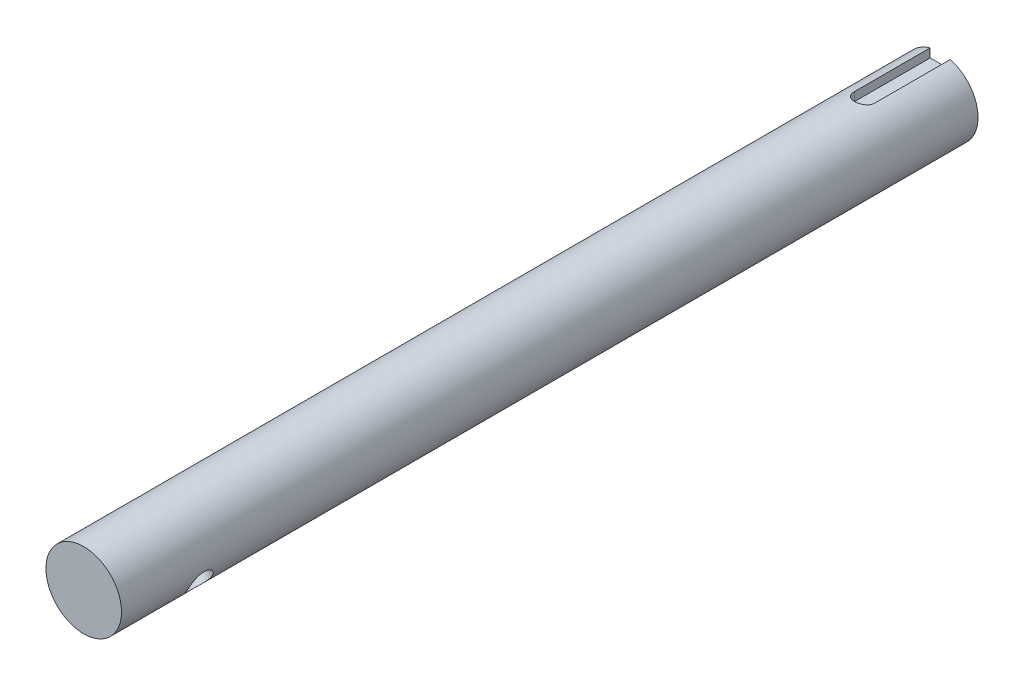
ISO-10303-21;
HEADER;
FILE_DESCRIPTION(('STEP AP214'),'2;1');
FILE_NAME('part.step','',(''),(''),'','','');
FILE_SCHEMA(('AUTOMOTIVE_DESIGN { 1 0 10303 214 1 1 1 1 }'));
ENDSEC;
DATA;
#1=APPLICATION_CONTEXT('core data for automotive mechanical design processes');
#2=APPLICATION_PROTOCOL_DEFINITION('international standard','automotive_design',2000,#1);
#3=PRODUCT_CONTEXT('',#1,'mechanical');
#4=PRODUCT('Part','Part','',(#3));
#5=PRODUCT_RELATED_PRODUCT_CATEGORY('part','',(#4));
#6=PRODUCT_DEFINITION_FORMATION('','',#4);
#7=PRODUCT_DEFINITION_CONTEXT('part definition',#1,'design');
#8=PRODUCT_DEFINITION('design','',#6,#7);
#9=PRODUCT_DEFINITION_SHAPE('','',#8);
#10=(LENGTH_UNIT() NAMED_UNIT(*) SI_UNIT(.MILLI.,.METRE.));
#11=(NAMED_UNIT(*) PLANE_ANGLE_UNIT() SI_UNIT($,.RADIAN.));
#12=(NAMED_UNIT(*) SI_UNIT($,.STERADIAN.) SOLID_ANGLE_UNIT());
#13=UNCERTAINTY_MEASURE_WITH_UNIT(LENGTH_MEASURE(1.E-05),#10,'distance_accuracy_value','');
#14=(GEOMETRIC_REPRESENTATION_CONTEXT(3) GLOBAL_UNCERTAINTY_ASSIGNED_CONTEXT((#13)) GLOBAL_UNIT_ASSIGNED_CONTEXT((#10,
#11,#12)) REPRESENTATION_CONTEXT('',''));
#15=CARTESIAN_POINT('',(0.,0.,0.));
#16=DIRECTION('',(0.,0.,1.));
#17=DIRECTION('',(1.,0.,0.));
#18=AXIS2_PLACEMENT_3D('',#15,#16,#17);
#19=CARTESIAN_POINT('',(0.,0.,340.));
#20=DIRECTION('',(0.,0.,-1.));
#21=DIRECTION('',(-1.,0.,0.));
#22=AXIS2_PLACEMENT_3D('',#19,#20,#21);
#23=CYLINDRICAL_SURFACE('',#22,15.);
#24=CARTESIAN_POINT('',(-9.74744871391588,11.4011948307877,307.));
#25=CARTESIAN_POINT('',(-9.74744729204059,11.4011954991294,307.27234087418));
#26=CARTESIAN_POINT('',(-9.76549911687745,11.385836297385,307.544673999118));
#27=CARTESIAN_POINT('',(-9.83637337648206,11.3246589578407,308.081272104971));
#28=CARTESIAN_POINT('',(-9.88920153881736,11.2788358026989,308.345535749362));
#29=CARTESIAN_POINT('',(-10.0258547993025,11.1575304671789,308.858134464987));
#30=CARTESIAN_POINT('',(-10.1096191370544,11.0821064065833,309.106499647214));
#31=CARTESIAN_POINT('',(-10.3030570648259,10.9024938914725,309.58180024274));
#32=CARTESIAN_POINT('',(-10.4127363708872,10.7982990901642,309.808730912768));
#33=CARTESIAN_POINT('',(-10.6564300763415,10.5579706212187,310.243599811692));
#34=CARTESIAN_POINT('',(-10.7911704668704,10.4208339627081,310.450577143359));
#35=CARTESIAN_POINT('',(-11.0754033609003,10.1182251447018,310.831034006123));
#36=CARTESIAN_POINT('',(-11.2248982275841,9.95274844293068,311.004508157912));
#37=CARTESIAN_POINT('',(-11.5357747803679,9.59083866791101,311.317394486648));
#38=CARTESIAN_POINT('',(-11.6973648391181,9.39371055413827,311.45579985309));
#39=CARTESIAN_POINT('',(-12.0213835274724,8.97531163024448,311.687957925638));
#40=CARTESIAN_POINT('',(-12.1838119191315,8.75404734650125,311.781722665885));
#41=CARTESIAN_POINT('',(-12.4968862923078,8.30066554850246,311.918679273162));
#42=CARTESIAN_POINT('',(-12.6477455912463,8.06919351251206,311.963517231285));
#43=CARTESIAN_POINT('',(-12.9380246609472,7.59504475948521,312.006581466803));
#44=CARTESIAN_POINT('',(-13.0774473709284,7.3523709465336,312.004819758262));
#45=CARTESIAN_POINT('',(-13.3354109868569,6.87299459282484,311.95577872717));
#46=CARTESIAN_POINT('',(-13.4545564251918,6.63643115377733,311.910287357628));
#47=CARTESIAN_POINT('',(-13.6760714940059,6.16704605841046,311.778035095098));
#48=CARTESIAN_POINT('',(-13.7784399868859,5.93422465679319,311.691271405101));
#49=CARTESIAN_POINT('',(-13.9668145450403,5.47633461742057,311.47789341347));
#50=CARTESIAN_POINT('',(-14.052587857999,5.25140810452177,311.350770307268));
#51=CARTESIAN_POINT('',(-14.2065729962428,4.81933307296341,311.060701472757));
#52=CARTESIAN_POINT('',(-14.2747799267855,4.61218952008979,310.897745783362));
#53=CARTESIAN_POINT('',(-14.3978405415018,4.21282784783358,310.531628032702));
#54=CARTESIAN_POINT('',(-14.4519143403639,4.02177161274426,310.326934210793));
#55=CARTESIAN_POINT('',(-14.544489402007,3.6729389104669,309.887756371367));
#56=CARTESIAN_POINT('',(-14.5829882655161,3.51516757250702,309.65326777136));
#57=CARTESIAN_POINT('',(-14.6471857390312,3.23738262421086,309.156731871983));
#58=CARTESIAN_POINT('',(-14.6726940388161,3.1179393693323,308.894339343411));
#59=CARTESIAN_POINT('',(-14.7122043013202,2.9258797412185,308.352143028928));
#60=CARTESIAN_POINT('',(-14.72621108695,2.8532437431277,308.072346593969));
#61=CARTESIAN_POINT('',(-14.7437808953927,2.760986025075,307.516808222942));
#62=CARTESIAN_POINT('',(-14.7477865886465,2.73912036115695,307.241452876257));
#63=CARTESIAN_POINT('',(-14.7470667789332,2.74299828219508,306.69111925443));
#64=CARTESIAN_POINT('',(-14.7423428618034,2.76873321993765,306.41614091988));
#65=CARTESIAN_POINT('',(-14.723992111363,2.86465938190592,305.884215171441));
#66=CARTESIAN_POINT('',(-14.7106766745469,2.93329313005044,305.626972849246));
#67=CARTESIAN_POINT('',(-14.6742753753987,3.11026485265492,305.127281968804));
#68=CARTESIAN_POINT('',(-14.6511877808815,3.21860986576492,304.884836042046));
#69=CARTESIAN_POINT('',(-14.5926658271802,3.47444912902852,304.413097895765));
#70=CARTESIAN_POINT('',(-14.5568630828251,3.62307610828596,304.184466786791));
#71=CARTESIAN_POINT('',(-14.4710104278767,3.95205157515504,303.754269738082));
#72=CARTESIAN_POINT('',(-14.4209563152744,4.13240941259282,303.552711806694));
#73=CARTESIAN_POINT('',(-14.3017865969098,4.52808283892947,303.172360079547));
#74=CARTESIAN_POINT('',(-14.2318697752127,4.74466282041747,302.995128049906));
#75=CARTESIAN_POINT('',(-14.0724165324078,5.19854474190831,302.68041928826));
#76=CARTESIAN_POINT('',(-13.9828808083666,5.43584594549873,302.542941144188));
#77=CARTESIAN_POINT('',(-13.7841868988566,5.92152853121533,302.312899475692));
#78=CARTESIAN_POINT('',(-13.6751630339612,6.16982582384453,302.22004361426));
#79=CARTESIAN_POINT('',(-13.4380843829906,6.6704161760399,302.0813612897));
#80=CARTESIAN_POINT('',(-13.3100364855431,6.92270775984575,302.035517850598));
#81=CARTESIAN_POINT('',(-13.0442321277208,7.41091353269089,301.993689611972));
#82=CARTESIAN_POINT('',(-12.9072148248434,7.64704014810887,301.995462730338));
#83=CARTESIAN_POINT('',(-12.6226409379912,8.10816422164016,302.043286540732));
#84=CARTESIAN_POINT('',(-12.4750852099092,8.33316258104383,302.089333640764));
#85=CARTESIAN_POINT('',(-12.1770955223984,8.76274336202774,302.22291117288));
#86=CARTESIAN_POINT('',(-12.0267445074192,8.96759329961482,302.309771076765));
#87=CARTESIAN_POINT('',(-11.7265520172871,9.35673217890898,302.521887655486));
#88=CARTESIAN_POINT('',(-11.5767106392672,9.54101739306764,302.647151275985));
#89=CARTESIAN_POINT('',(-11.2780008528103,9.89251639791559,302.93784756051));
#90=CARTESIAN_POINT('',(-11.1293729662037,10.0588478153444,303.104593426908));
#91=CARTESIAN_POINT('',(-10.84556410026,10.3642308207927,303.471286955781));
#92=CARTESIAN_POINT('',(-10.7103874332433,10.5032736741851,303.671245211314));
#93=CARTESIAN_POINT('',(-10.4551321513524,10.7575078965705,304.108046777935));
#94=CARTESIAN_POINT('',(-10.3358516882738,10.8715525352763,304.346027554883));
#95=CARTESIAN_POINT('',(-10.1259838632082,11.0673008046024,304.846672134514));
#96=CARTESIAN_POINT('',(-10.0353890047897,11.149012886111,305.109329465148));
#97=CARTESIAN_POINT('',(-9.89233906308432,11.2760995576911,305.639809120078));
#98=CARTESIAN_POINT('',(-9.83834509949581,11.3229497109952,305.906861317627));
#99=CARTESIAN_POINT('',(-9.76590677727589,11.3854916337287,306.449280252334));
#100=CARTESIAN_POINT('',(-9.74745015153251,11.4011941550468,306.724644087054));
#101=CARTESIAN_POINT('',(-9.74744871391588,11.4011948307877,307.));
#102=B_SPLINE_CURVE_WITH_KNOTS('',3,(#24,#25,#26,#27,#28,#29,#30,#31,#32,#33,#34,#35,#36,#37,
#38,#39,#40,#41,#42,#43,#44,#45,#46,#47,#48,#49,#50,#51,#52,#53,#54,#55,#56,#57,#58,#59,#60,#61,
#62,#63,#64,#65,#66,#67,#68,#69,#70,#71,#72,#73,#74,#75,#76,#77,#78,#79,#80,#81,#82,#83,#84,#85,
#86,#87,#88,#89,#90,#91,#92,#93,#94,#95,#96,#97,#98,#99,#100,#101),.UNSPECIFIED.,.T.,.F.,(4,2,2,
2,2,2,2,2,2,2,2,2,2,2,2,2,2,2,2,2,2,2,2,2,2,2,2,2,2,2,2,2,2,2,2,2,2,2,4),(0.,0.816002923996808,
1.63214027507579,2.44668313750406,3.26140583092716,4.1050668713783,4.94886325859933,
5.81467530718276,6.68025381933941,7.51571593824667,8.35096266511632,9.15345024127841,
9.95599220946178,10.7690827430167,11.582399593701,12.4340087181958,13.2857489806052,
14.1496319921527,15.0131525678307,15.8377145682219,16.6621267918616,17.4582197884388,
18.2544539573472,19.0759428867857,19.8976742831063,20.7589404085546,21.6201759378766,
22.4756895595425,23.3308941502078,24.1459042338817,24.960848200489,25.7628478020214,
26.5649925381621,27.3967759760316,28.2288252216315,29.0934451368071,29.9578389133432,
30.7831606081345,31.6081973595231),.UNSPECIFIED.);
#103=CARTESIAN_POINT('',(-9.74744871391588,11.4011948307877,307.));
#104=VERTEX_POINT('',#103);
#105=EDGE_CURVE('E37',#104,#104,#102,.T.);
#106=ORIENTED_EDGE('',*,*,#105,.T.);
#107=EDGE_LOOP('',(#106));
#108=FACE_BOUND('',#107,.T.);
#109=CARTESIAN_POINT('',(14.7474487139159,-2.74094079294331,307.));
#110=CARTESIAN_POINT('',(14.7474485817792,-2.74093922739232,306.72765912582));
#111=CARTESIAN_POINT('',(14.7431730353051,-2.76425216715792,306.455326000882));
#112=CARTESIAN_POINT('',(14.7256290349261,-2.85621974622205,305.918727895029));
#113=CARTESIAN_POINT('',(14.7123590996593,-2.92488185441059,305.654464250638));
#114=CARTESIAN_POINT('',(14.675632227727,-3.10387971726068,305.141865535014));
#115=CARTESIAN_POINT('',(14.6521952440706,-3.21413379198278,304.893500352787));
#116=CARTESIAN_POINT('',(14.5933652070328,-3.47146220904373,304.41819975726));
#117=CARTESIAN_POINT('',(14.5579695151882,-3.61854467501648,304.191269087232));
#118=CARTESIAN_POINT('',(14.4716858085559,-3.94975384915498,303.756400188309));
#119=CARTESIAN_POINT('',(14.42029217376,-4.13501077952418,303.549422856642));
#120=CARTESIAN_POINT('',(14.3003416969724,-4.53246809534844,303.168965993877));
#121=CARTESIAN_POINT('',(14.231782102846,-4.74467279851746,302.995491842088));
#122=CARTESIAN_POINT('',(14.073797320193,-5.19485467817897,302.682605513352));
#123=CARTESIAN_POINT('',(13.9838743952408,-5.43335983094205,302.54420014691));
#124=CARTESIAN_POINT('',(13.7835396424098,-5.92316770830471,302.312042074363));
#125=CARTESIAN_POINT('',(13.6731333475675,-6.17446696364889,302.218277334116));
#126=CARTESIAN_POINT('',(13.4370303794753,-6.6722882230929,302.081320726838));
#127=CARTESIAN_POINT('',(13.3119993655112,-6.91867222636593,302.036482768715));
#128=CARTESIAN_POINT('',(13.0465140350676,-7.40713565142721,301.993418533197));
#129=CARTESIAN_POINT('',(12.9060637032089,-7.6492161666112,301.995180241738));
#130=CARTESIAN_POINT('',(12.6198934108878,-8.11230738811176,302.04422127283));
#131=CARTESIAN_POINT('',(12.4745961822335,-8.33377208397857,302.089712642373));
#132=CARTESIAN_POINT('',(12.1788542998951,-8.76030230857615,302.221964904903));
#133=CARTESIAN_POINT('',(12.0284092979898,-8.96536672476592,302.308728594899));
#134=CARTESIAN_POINT('',(11.7260521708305,-9.35744889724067,302.52210658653));
#135=CARTESIAN_POINT('',(11.5741467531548,-9.54419402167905,302.649229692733));
#136=CARTESIAN_POINT('',(11.2769513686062,-9.89358657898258,302.939298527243));
#137=CARTESIAN_POINT('',(11.1316632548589,-10.0562272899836,303.102254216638));
#138=CARTESIAN_POINT('',(10.8473362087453,-10.3624817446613,303.468371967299));
#139=CARTESIAN_POINT('',(10.7089135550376,-10.5048391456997,303.673065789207));
#140=CARTESIAN_POINT('',(10.4531031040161,-10.7594278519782,304.112243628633));
#141=CARTESIAN_POINT('',(10.3357185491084,-10.8716545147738,304.34673222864));
#142=CARTESIAN_POINT('',(10.1272484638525,-11.0661436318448,304.843268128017));
#143=CARTESIAN_POINT('',(10.0365617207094,-11.1479560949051,305.105660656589));
#144=CARTESIAN_POINT('',(9.88998833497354,-11.2782028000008,305.647856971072));
#145=CARTESIAN_POINT('',(9.83408710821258,-11.326651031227,305.927653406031));
#146=CARTESIAN_POINT('',(9.7629744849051,-11.3879957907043,306.483191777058));
#147=CARTESIAN_POINT('',(9.74604111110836,-11.4023976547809,306.758547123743));
#148=CARTESIAN_POINT('',(9.74903958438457,-11.3998353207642,307.308880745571));
#149=CARTESIAN_POINT('',(9.76896473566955,-11.3828768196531,307.58385908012));
#150=CARTESIAN_POINT('',(9.84286385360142,-11.3190215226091,308.11578482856));
#151=CARTESIAN_POINT('',(9.89564470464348,-11.2731731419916,308.373027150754));
#152=CARTESIAN_POINT('',(10.0307060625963,-11.1531628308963,308.872718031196));
#153=CARTESIAN_POINT('',(10.1129917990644,-11.0789958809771,309.115163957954));
#154=CARTESIAN_POINT('',(10.3052941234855,-10.9003947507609,309.586902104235));
#155=CARTESIAN_POINT('',(10.4161074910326,-10.7950751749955,309.815533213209));
#156=CARTESIAN_POINT('',(10.6580822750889,-10.5562368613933,310.245730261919));
#157=CARTESIAN_POINT('',(10.7892496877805,-10.4227098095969,310.447288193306));
#158=CARTESIAN_POINT('',(11.0723280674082,-10.121669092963,310.827639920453));
#159=CARTESIAN_POINT('',(11.2249334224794,-9.95282935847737,311.004871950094));
#160=CARTESIAN_POINT('',(11.5382800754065,-9.58779783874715,311.31958071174));
#161=CARTESIAN_POINT('',(11.6990210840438,-9.39160702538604,311.457058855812));
#162=CARTESIAN_POINT('',(12.0202875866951,-8.97669175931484,311.687100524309));
#163=CARTESIAN_POINT('',(12.1808074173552,-8.75812567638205,311.77995638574));
#164=CARTESIAN_POINT('',(12.4957920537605,-8.30251436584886,311.918638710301));
#165=CARTESIAN_POINT('',(12.6502590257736,-8.06547584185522,311.964482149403));
#166=CARTESIAN_POINT('',(12.9401554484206,-7.59117962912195,312.006310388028));
#167=CARTESIAN_POINT('',(13.0761384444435,-7.35445585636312,312.004537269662));
#168=CARTESIAN_POINT('',(13.333196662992,-6.87744560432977,311.956713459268));
#169=CARTESIAN_POINT('',(13.4542730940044,-6.63715941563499,311.910666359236));
#170=CARTESIAN_POINT('',(13.6773061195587,-6.1643023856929,311.77708882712));
#171=CARTESIAN_POINT('',(13.7795358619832,-5.93166961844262,311.690228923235));
#172=CARTESIAN_POINT('',(13.966443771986,-5.47712585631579,311.478112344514));
#173=CARTESIAN_POINT('',(14.0511187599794,-5.25521680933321,311.352848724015));
#174=CARTESIAN_POINT('',(14.2061709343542,-4.82077704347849,311.06215243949));
#175=CARTESIAN_POINT('',(14.2759042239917,-4.60889580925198,310.895406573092));
#176=CARTESIAN_POINT('',(14.3984692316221,-4.21041861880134,310.528713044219));
#177=CARTESIAN_POINT('',(14.4512955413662,-4.02383076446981,310.328754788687));
#178=CARTESIAN_POINT('',(14.543841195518,-3.67565609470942,309.891953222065));
#179=CARTESIAN_POINT('',(14.5829665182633,-3.5153338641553,309.653972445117));
#180=CARTESIAN_POINT('',(14.6475555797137,-3.23570886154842,309.153327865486));
#181=CARTESIAN_POINT('',(14.6730228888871,-3.11639537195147,308.890670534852));
#182=CARTESIAN_POINT('',(14.7115582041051,-2.92896715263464,308.360190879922));
#183=CARTESIAN_POINT('',(14.7251346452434,-2.85878193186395,308.093138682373));
#184=CARTESIAN_POINT('',(14.7430783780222,-2.7647775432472,307.550719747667));
#185=CARTESIAN_POINT('',(14.7474488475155,-2.74094237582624,307.275355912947));
#186=CARTESIAN_POINT('',(14.7474487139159,-2.74094079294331,307.));
#187=B_SPLINE_CURVE_WITH_KNOTS('',3,(#109,#110,#111,#112,#113,#114,#115,#116,#117,#118,#119,
#120,#121,#122,#123,#124,#125,#126,#127,#128,#129,#130,#131,#132,#133,#134,#135,#136,#137,#138,
#139,#140,#141,#142,#143,#144,#145,#146,#147,#148,#149,#150,#151,#152,#153,#154,#155,#156,#157,
#158,#159,#160,#161,#162,#163,#164,#165,#166,#167,#168,#169,#170,#171,#172,#173,#174,#175,#176,
#177,#178,#179,#180,#181,#182,#183,#184,#185,#186),.UNSPECIFIED.,.T.,.F.,(4,2,2,2,2,2,2,2,2,2,2,
2,2,2,2,2,2,2,2,2,2,2,2,2,2,2,2,2,2,2,2,2,2,2,2,2,2,2,4),(0.,0.816002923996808,1.63214027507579,
2.44668313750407,3.26140583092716,4.1050668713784,4.94886325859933,5.81467530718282,
6.68025381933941,7.51571593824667,8.35096266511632,9.15345024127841,9.95599220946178,
10.7690827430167,11.582399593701,12.4340087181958,13.2857489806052,14.1496319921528,
15.0131525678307,15.8377145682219,16.6621267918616,17.4582197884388,18.2544539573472,
19.0759428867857,19.8976742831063,20.7589404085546,21.6201759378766,22.4756895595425,
23.3308941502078,24.1459042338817,24.960848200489,25.7628478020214,26.5649925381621,
27.3967759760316,28.2288252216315,29.0934451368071,29.9578389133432,30.7831606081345,
31.6081973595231),.UNSPECIFIED.);
#188=CARTESIAN_POINT('',(14.7474487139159,-2.74094079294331,307.));
#189=VERTEX_POINT('',#188);
#190=EDGE_CURVE('E102',#189,#189,#187,.T.);
#191=ORIENTED_EDGE('',*,*,#190,.T.);
#192=EDGE_LOOP('',(#191));
#193=FACE_BOUND('',#192,.T.);
#194=CARTESIAN_POINT('',(0.,0.,340.));
#195=DIRECTION('',(0.,0.,1.));
#196=DIRECTION('',(1.,0.,0.));
#197=AXIS2_PLACEMENT_3D('',#194,#195,#196);
#198=CIRCLE('',#197,15.);
#199=CARTESIAN_POINT('',(15.,0.,340.));
#200=VERTEX_POINT('',#199);
#201=EDGE_CURVE('E12',#200,#200,#198,.T.);
#202=ORIENTED_EDGE('',*,*,#201,.F.);
#203=EDGE_LOOP('',(#202));
#204=FACE_BOUND('',#203,.T.);
#205=CARTESIAN_POINT('',(0.,15.,26.));
#206=CARTESIAN_POINT('',(-0.220509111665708,14.9999966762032,26.0000052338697));
#207=CARTESIAN_POINT('',(-0.441074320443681,14.995089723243,26.0182952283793));
#208=CARTESIAN_POINT('',(-0.875850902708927,14.9759914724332,26.0908424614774));
#209=CARTESIAN_POINT('',(-1.09005916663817,14.9617957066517,26.1451170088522));
#210=CARTESIAN_POINT('',(-1.50578317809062,14.9256866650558,26.2877433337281));
#211=CARTESIAN_POINT('',(-1.70731490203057,14.9037833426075,26.376051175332));
#212=CARTESIAN_POINT('',(-2.09270737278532,14.8545739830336,26.5840744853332));
#213=CARTESIAN_POINT('',(-2.27656694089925,14.8272675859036,26.7037920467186));
#214=CARTESIAN_POINT('',(-2.62565900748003,14.7694922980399,26.9741670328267));
#215=CARTESIAN_POINT('',(-2.79042337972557,14.7389693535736,27.1254173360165));
#216=CARTESIAN_POINT('',(-3.09257427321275,14.6785481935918,27.4532969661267));
#217=CARTESIAN_POINT('',(-3.22995726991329,14.6486500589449,27.6299295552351));
#218=CARTESIAN_POINT('',(-3.4757281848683,14.5923107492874,28.0072964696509));
#219=CARTESIAN_POINT('',(-3.58357755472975,14.5659377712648,28.2083926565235));
#220=CARTESIAN_POINT('',(-3.76375096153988,14.5204295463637,28.6266802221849));
#221=CARTESIAN_POINT('',(-3.83608154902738,14.5012929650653,28.8438686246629));
#222=CARTESIAN_POINT('',(-3.94153840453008,14.472982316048,29.28299107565));
#223=CARTESIAN_POINT('',(-3.97551340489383,14.4635929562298,29.5047070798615));
#224=CARTESIAN_POINT('',(-4.00594069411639,14.4551966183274,29.9508753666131));
#225=CARTESIAN_POINT('',(-4.00239999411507,14.4561877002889,30.1753271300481));
#226=CARTESIAN_POINT('',(-3.95857020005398,14.4682475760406,30.6139708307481));
#227=CARTESIAN_POINT('',(-3.91930812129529,14.4790347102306,30.828274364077));
#228=CARTESIAN_POINT('',(-3.80679497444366,14.5090202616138,31.2471366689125));
#229=CARTESIAN_POINT('',(-3.7335411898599,14.5282193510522,31.4516946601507));
#230=CARTESIAN_POINT('',(-3.55428713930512,14.5731132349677,31.8479362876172));
#231=CARTESIAN_POINT('',(-3.44792682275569,14.5988788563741,32.0394486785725));
#232=CARTESIAN_POINT('',(-3.20573007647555,14.6539645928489,32.402268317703));
#233=CARTESIAN_POINT('',(-3.06988784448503,14.6832854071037,32.5735715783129));
#234=CARTESIAN_POINT('',(-2.76733214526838,14.7433502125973,32.8969779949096));
#235=CARTESIAN_POINT('',(-2.59975625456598,14.7741094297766,33.0482726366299));
#236=CARTESIAN_POINT('',(-2.24123533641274,14.8327276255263,33.3207775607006));
#237=CARTESIAN_POINT('',(-2.05028938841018,14.8605864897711,33.4419866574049));
#238=CARTESIAN_POINT('',(-1.6491965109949,14.9104364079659,33.6512358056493));
#239=CARTESIAN_POINT('',(-1.43896980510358,14.9324014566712,33.7391295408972));
#240=CARTESIAN_POINT('',(-1.00600458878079,14.96780088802,33.8780943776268));
#241=CARTESIAN_POINT('',(-0.783268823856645,14.981237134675,33.9291735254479));
#242=CARTESIAN_POINT('',(-0.33850816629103,14.9977831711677,33.9917897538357));
#243=CARTESIAN_POINT('',(-0.11664847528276,15.0011799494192,34.0044260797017));
#244=CARTESIAN_POINT('',(0.326020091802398,14.9980894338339,33.9928336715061));
#245=CARTESIAN_POINT('',(0.546829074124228,14.9916031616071,33.9686087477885));
#246=CARTESIAN_POINT('',(0.977204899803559,14.9696607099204,33.88488310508));
#247=CARTESIAN_POINT('',(1.18689970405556,14.9543605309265,33.8259955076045));
#248=CARTESIAN_POINT('',(1.59341394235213,14.9165258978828,33.6753281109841));
#249=CARTESIAN_POINT('',(1.79023197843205,14.8939906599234,33.5835447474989));
#250=CARTESIAN_POINT('',(2.1696769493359,14.8435132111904,33.3676522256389));
#251=CARTESIAN_POINT('',(2.35195037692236,14.8154737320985,33.2429450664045));
#252=CARTESIAN_POINT('',(2.69336927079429,14.7572290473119,32.965496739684));
#253=CARTESIAN_POINT('',(2.85251015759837,14.7270234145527,32.8127500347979));
#254=CARTESIAN_POINT('',(3.14777848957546,14.6667949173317,32.4784288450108));
#255=CARTESIAN_POINT('',(3.28313038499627,14.6368012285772,32.2961628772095));
#256=CARTESIAN_POINT('',(3.52134382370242,14.5813289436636,31.9108706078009));
#257=CARTESIAN_POINT('',(3.62420672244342,14.5558501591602,31.707845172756));
#258=CARTESIAN_POINT('',(3.79374823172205,14.5125853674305,31.2878093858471));
#259=CARTESIAN_POINT('',(3.8606362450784,14.4947549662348,31.0708883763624));
#260=CARTESIAN_POINT('',(3.95682410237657,14.4687965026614,30.6283213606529));
#261=CARTESIAN_POINT('',(3.98613355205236,14.4606659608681,30.4026775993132));
#262=CARTESIAN_POINT('',(4.00577979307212,14.4552348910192,29.9570104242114));
#263=CARTESIAN_POINT('',(3.99736311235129,14.4575879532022,29.7370453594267));
#264=CARTESIAN_POINT('',(3.94468751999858,14.4720479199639,29.3017929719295));
#265=CARTESIAN_POINT('',(3.9004295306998,14.4841545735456,29.0865055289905));
#266=CARTESIAN_POINT('',(3.77805031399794,14.5165514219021,28.6682884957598));
#267=CARTESIAN_POINT('',(3.70019322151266,14.5367777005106,28.4652763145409));
#268=CARTESIAN_POINT('',(3.51303109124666,14.5831363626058,28.0750423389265));
#269=CARTESIAN_POINT('',(3.40372112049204,14.6092696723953,27.8878230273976));
#270=CARTESIAN_POINT('',(3.15297818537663,14.6654584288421,27.5285392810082));
#271=CARTESIAN_POINT('',(3.01069459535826,14.6956066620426,27.357082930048));
#272=CARTESIAN_POINT('',(2.69966107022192,14.7559100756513,27.040075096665));
#273=CARTESIAN_POINT('',(2.53090470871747,14.7860652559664,26.8945299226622));
#274=CARTESIAN_POINT('',(2.16735996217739,14.8437562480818,26.6304155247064));
#275=CARTESIAN_POINT('',(1.97209192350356,14.8712222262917,26.5124899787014));
#276=CARTESIAN_POINT('',(1.56377728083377,14.9196762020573,26.3113251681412));
#277=CARTESIAN_POINT('',(1.35074218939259,14.9406683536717,26.2280636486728));
#278=CARTESIAN_POINT('',(0.948749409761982,14.9710950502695,26.109449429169));
#279=CARTESIAN_POINT('',(0.761524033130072,14.9818554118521,26.068501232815));
#280=CARTESIAN_POINT('',(0.382879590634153,14.9963089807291,26.0137755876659));
#281=CARTESIAN_POINT('',(0.191460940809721,15.0000028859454,25.9999954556));
#282=CARTESIAN_POINT('',(0.,15.,26.));
#283=B_SPLINE_CURVE_WITH_KNOTS('',3,(#205,#206,#207,#208,#209,#210,#211,#212,#213,#214,#215,
#216,#217,#218,#219,#220,#221,#222,#223,#224,#225,#226,#227,#228,#229,#230,#231,#232,#233,#234,
#235,#236,#237,#238,#239,#240,#241,#242,#243,#244,#245,#246,#247,#248,#249,#250,#251,#252,#253,
#254,#255,#256,#257,#258,#259,#260,#261,#262,#263,#264,#265,#266,#267,#268,#269,#270,#271,#272,
#273,#274,#275,#276,#277,#278,#279,#280,#281,#282),.UNSPECIFIED.,.T.,.F.,(4,2,2,2,2,2,2,2,2,2,2,
2,2,2,2,2,2,2,2,2,2,2,2,2,2,2,2,2,2,2,2,2,2,2,2,2,2,2,4),(0.,0.660825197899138,1.3219684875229,
1.98226110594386,2.6425977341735,3.31669795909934,3.99088489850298,4.67665165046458,
5.36229188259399,6.03244316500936,6.70246920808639,7.35382004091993,8.00522293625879,
8.66397346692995,9.32285376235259,10.0032251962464,10.6836234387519,11.3669761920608,
12.0501795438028,12.7136543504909,13.377060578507,14.0290707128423,14.6811515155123,
15.346005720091,16.0109913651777,16.6947299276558,17.3784399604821,18.0581259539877,
18.7376381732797,19.394866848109,20.0520786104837,20.7042153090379,21.3564543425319,
22.0278867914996,22.6994824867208,23.3854450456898,24.0709665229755,24.6447963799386,
25.2185695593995),.UNSPECIFIED.);
#284=CARTESIAN_POINT('',(-4.,14.456832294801,30.));
#285=VERTEX_POINT('',#284);
#286=CARTESIAN_POINT('',(4.,14.456832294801,30.));
#287=VERTEX_POINT('',#286);
#288=EDGE_CURVE('E106',#285,#287,#283,.T.);
#289=ORIENTED_EDGE('',*,*,#288,.F.);
#290=DIRECTION('',(0.,0.,-1.));
#291=VECTOR('',#290,1.);
#292=CARTESIAN_POINT('',(-4.,14.456832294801,340.));
#293=LINE('',#292,#291);
#294=CARTESIAN_POINT('',(-4.,14.456832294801,0.));
#295=VERTEX_POINT('',#294);
#296=EDGE_CURVE('E152',#295,#285,#293,.F.);
#297=ORIENTED_EDGE('',*,*,#296,.F.);
#298=CARTESIAN_POINT('',(0.,0.,0.));
#299=DIRECTION('',(0.,0.,1.));
#300=DIRECTION('',(1.,0.,0.));
#301=AXIS2_PLACEMENT_3D('',#298,#299,#300);
#302=CIRCLE('',#301,15.);
#303=CARTESIAN_POINT('',(4.,14.456832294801,0.));
#304=VERTEX_POINT('',#303);
#305=EDGE_CURVE('E47',#295,#304,#302,.T.);
#306=ORIENTED_EDGE('',*,*,#305,.T.);
#307=DIRECTION('',(0.,0.,-1.));
#308=VECTOR('',#307,1.);
#309=CARTESIAN_POINT('',(4.,14.456832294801,340.));
#310=LINE('',#309,#308);
#311=EDGE_CURVE('E55',#304,#287,#310,.F.);
#312=ORIENTED_EDGE('',*,*,#311,.T.);
#313=EDGE_LOOP('',(#289,#297,#306,#312));
#314=FACE_BOUND('',#313,.T.);
#315=ADVANCED_FACE('F33',(#108,#193,#204,#314),#23,.T.);
#316=CARTESIAN_POINT('',(0.,0.,0.));
#317=DIRECTION('',(0.,0.,1.));
#318=DIRECTION('',(1.,0.,0.));
#319=AXIS2_PLACEMENT_3D('',#316,#317,#318);
#320=PLANE('',#319);
#321=CARTESIAN_POINT('',(0.,0.,0.));
#322=DIRECTION('',(0.,0.,-1.));
#323=DIRECTION('',(-1.,0.,0.));
#324=AXIS2_PLACEMENT_3D('',#321,#322,#323);
#325=CIRCLE('',#324,3.39999999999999);
#326=CARTESIAN_POINT('',(-3.39999999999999,0.,0.));
#327=VERTEX_POINT('',#326);
#328=EDGE_CURVE('E95',#327,#327,#325,.T.);
#329=ORIENTED_EDGE('',*,*,#328,.F.);
#330=EDGE_LOOP('',(#329));
#331=FACE_BOUND('',#330,.T.);
#332=DIRECTION('',(0.,1.,0.));
#333=VECTOR('',#332,1.);
#334=CARTESIAN_POINT('',(-4.,11.,0.));
#335=LINE('',#334,#333);
#336=CARTESIAN_POINT('',(-4.,11.,0.));
#337=VERTEX_POINT('',#336);
#338=EDGE_CURVE('E63',#337,#295,#335,.T.);
#339=ORIENTED_EDGE('',*,*,#338,.F.);
#340=DIRECTION('',(1.,0.,0.));
#341=VECTOR('',#340,1.);
#342=CARTESIAN_POINT('',(-4.,11.,0.));
#343=LINE('',#342,#341);
#344=CARTESIAN_POINT('',(4.,11.,0.));
#345=VERTEX_POINT('',#344);
#346=EDGE_CURVE('E160',#337,#345,#343,.T.);
#347=ORIENTED_EDGE('',*,*,#346,.T.);
#348=DIRECTION('',(0.,1.,0.));
#349=VECTOR('',#348,1.);
#350=CARTESIAN_POINT('',(4.,11.,0.));
#351=LINE('',#350,#349);
#352=EDGE_CURVE('E113',#345,#304,#351,.T.);
#353=ORIENTED_EDGE('',*,*,#352,.T.);
#354=ORIENTED_EDGE('',*,*,#305,.F.);
#355=EDGE_LOOP('',(#339,#347,#353,#354));
#356=FACE_BOUND('',#355,.T.);
#357=ADVANCED_FACE('F132',(#331,#356),#320,.F.);
#358=CARTESIAN_POINT('',(0.,0.,340.));
#359=DIRECTION('',(0.,0.,1.));
#360=DIRECTION('',(1.,0.,0.));
#361=AXIS2_PLACEMENT_3D('',#358,#359,#360);
#362=PLANE('',#361);
#363=ORIENTED_EDGE('',*,*,#201,.T.);
#364=EDGE_LOOP('',(#363));
#365=FACE_BOUND('',#364,.T.);
#366=ADVANCED_FACE('F128',(#365),#362,.T.);
#367=CARTESIAN_POINT('',(-4.,15.,0.));
#368=DIRECTION('',(1.,0.,0.));
#369=DIRECTION('',(0.,0.,-1.));
#370=AXIS2_PLACEMENT_3D('',#367,#368,#369);
#371=PLANE('',#370);
#372=ORIENTED_EDGE('',*,*,#296,.T.);
#373=DIRECTION('',(0.,-1.,0.));
#374=VECTOR('',#373,1.);
#375=CARTESIAN_POINT('',(-4.,15.,30.));
#376=LINE('',#375,#374);
#377=CARTESIAN_POINT('',(-4.,11.,30.));
#378=VERTEX_POINT('',#377);
#379=EDGE_CURVE('E155',#285,#378,#376,.T.);
#380=ORIENTED_EDGE('',*,*,#379,.T.);
#381=DIRECTION('',(0.,0.,-1.));
#382=VECTOR('',#381,1.);
#383=CARTESIAN_POINT('',(-4.,11.,30.));
#384=LINE('',#383,#382);
#385=EDGE_CURVE('E227',#378,#337,#384,.T.);
#386=ORIENTED_EDGE('',*,*,#385,.T.);
#387=ORIENTED_EDGE('',*,*,#338,.T.);
#388=EDGE_LOOP('',(#372,#380,#386,#387));
#389=FACE_BOUND('',#388,.T.);
#390=ADVANCED_FACE('F125',(#389),#371,.T.);
#391=CARTESIAN_POINT('',(4.,15.,0.));
#392=DIRECTION('',(1.,0.,0.));
#393=DIRECTION('',(0.,0.,-1.));
#394=AXIS2_PLACEMENT_3D('',#391,#392,#393);
#395=PLANE('',#394);
#396=ORIENTED_EDGE('',*,*,#352,.F.);
#397=DIRECTION('',(0.,0.,-1.));
#398=VECTOR('',#397,1.);
#399=CARTESIAN_POINT('',(4.,11.,30.));
#400=LINE('',#399,#398);
#401=CARTESIAN_POINT('',(4.,11.,30.));
#402=VERTEX_POINT('',#401);
#403=EDGE_CURVE('E225',#402,#345,#400,.T.);
#404=ORIENTED_EDGE('',*,*,#403,.F.);
#405=DIRECTION('',(0.,-1.,0.));
#406=VECTOR('',#405,1.);
#407=CARTESIAN_POINT('',(4.,15.,30.));
#408=LINE('',#407,#406);
#409=EDGE_CURVE('E230',#287,#402,#408,.T.);
#410=ORIENTED_EDGE('',*,*,#409,.F.);
#411=ORIENTED_EDGE('',*,*,#311,.F.);
#412=EDGE_LOOP('',(#396,#404,#410,#411));
#413=FACE_BOUND('',#412,.T.);
#414=ADVANCED_FACE('F122',(#413),#395,.F.);
#415=CARTESIAN_POINT('',(-4.,11.,30.));
#416=DIRECTION('',(0.,-1.,0.));
#417=DIRECTION('',(0.,0.,-1.));
#418=AXIS2_PLACEMENT_3D('',#415,#416,#417);
#419=PLANE('',#418);
#420=ORIENTED_EDGE('',*,*,#385,.F.);
#421=CARTESIAN_POINT('',(0.,11.,30.));
#422=DIRECTION('',(0.,1.,0.));
#423=DIRECTION('',(0.,0.,1.));
#424=AXIS2_PLACEMENT_3D('',#421,#422,#423);
#425=CIRCLE('',#424,4.);
#426=EDGE_CURVE('E98',#378,#402,#425,.T.);
#427=ORIENTED_EDGE('',*,*,#426,.T.);
#428=ORIENTED_EDGE('',*,*,#403,.T.);
#429=ORIENTED_EDGE('',*,*,#346,.F.);
#430=EDGE_LOOP('',(#420,#427,#428,#429));
#431=FACE_BOUND('',#430,.T.);
#432=ADVANCED_FACE('F120',(#431),#419,.F.);
#433=CARTESIAN_POINT('',(0.,15.,30.));
#434=DIRECTION('',(0.,-1.,0.));
#435=DIRECTION('',(0.,0.,-1.));
#436=AXIS2_PLACEMENT_3D('',#433,#434,#435);
#437=CYLINDRICAL_SURFACE('',#436,4.);
#438=ORIENTED_EDGE('',*,*,#379,.F.);
#439=ORIENTED_EDGE('',*,*,#288,.T.);
#440=ORIENTED_EDGE('',*,*,#409,.T.);
#441=ORIENTED_EDGE('',*,*,#426,.F.);
#442=EDGE_LOOP('',(#438,#439,#440,#441));
#443=FACE_BOUND('',#442,.T.);
#444=ADVANCED_FACE('F115',(#443),#437,.F.);
#445=CARTESIAN_POINT('',(0.,0.,0.));
#446=DIRECTION('',(0.,0.,-1.));
#447=DIRECTION('',(-1.,0.,0.));
#448=AXIS2_PLACEMENT_3D('',#445,#446,#447);
#449=CYLINDRICAL_SURFACE('',#448,3.39999999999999);
#450=CARTESIAN_POINT('',(0.,0.,26.25));
#451=DIRECTION('',(0.,0.,-1.));
#452=DIRECTION('',(-1.,0.,0.));
#453=AXIS2_PLACEMENT_3D('',#450,#451,#452);
#454=CIRCLE('',#453,3.39999999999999);
#455=CARTESIAN_POINT('',(-3.39999999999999,0.,26.25));
#456=VERTEX_POINT('',#455);
#457=EDGE_CURVE('E93',#456,#456,#454,.T.);
#458=ORIENTED_EDGE('',*,*,#457,.F.);
#459=EDGE_LOOP('',(#458));
#460=FACE_BOUND('',#459,.T.);
#461=ORIENTED_EDGE('',*,*,#328,.T.);
#462=EDGE_LOOP('',(#461));
#463=FACE_BOUND('',#462,.T.);
#464=ADVANCED_FACE('F89',(#460,#463),#449,.F.);
#465=CARTESIAN_POINT('',(0.,0.,26.25));
#466=DIRECTION('',(0.,0.,-1.));
#467=DIRECTION('',(-1.,0.,0.));
#468=AXIS2_PLACEMENT_3D('',#465,#466,#467);
#469=CONICAL_SURFACE('',#468,3.39999999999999,1.02974425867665);
#470=CARTESIAN_POINT('',(0.,0.,28.2929261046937));
#471=VERTEX_POINT('',#470);
#472=VERTEX_LOOP('',#471);
#473=FACE_BOUND('',#472,.T.);
#474=ORIENTED_EDGE('',*,*,#457,.T.);
#475=EDGE_LOOP('',(#474));
#476=FACE_BOUND('',#475,.T.);
#477=ADVANCED_FACE('F85',(#473,#476),#469,.F.);
#478=CARTESIAN_POINT('',(-17.7451905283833,10.2451905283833,307.));
#479=DIRECTION('',(0.866025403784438,-0.500000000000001,0.));
#480=DIRECTION('',(0.500000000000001,0.866025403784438,0.));
#481=AXIS2_PLACEMENT_3D('',#478,#479,#480);
#482=CYLINDRICAL_SURFACE('',#481,4.99999999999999);
#483=ORIENTED_EDGE('',*,*,#190,.F.);
#484=EDGE_LOOP('',(#483));
#485=FACE_BOUND('',#484,.T.);
#486=ORIENTED_EDGE('',*,*,#105,.F.);
#487=EDGE_LOOP('',(#486));
#488=FACE_BOUND('',#487,.T.);
#489=ADVANCED_FACE('F88',(#485,#488),#482,.F.);
#490=CLOSED_SHELL('',(#315,#357,#366,#390,#414,#432,#444,#464,#477,#489));
#491=MANIFOLD_SOLID_BREP('B2',#490);
#492=ADVANCED_BREP_SHAPE_REPRESENTATION('',(#18,#491),#14);
#493=SHAPE_DEFINITION_REPRESENTATION(#9,#492);
ENDSEC;
END-ISO-10303-21;
